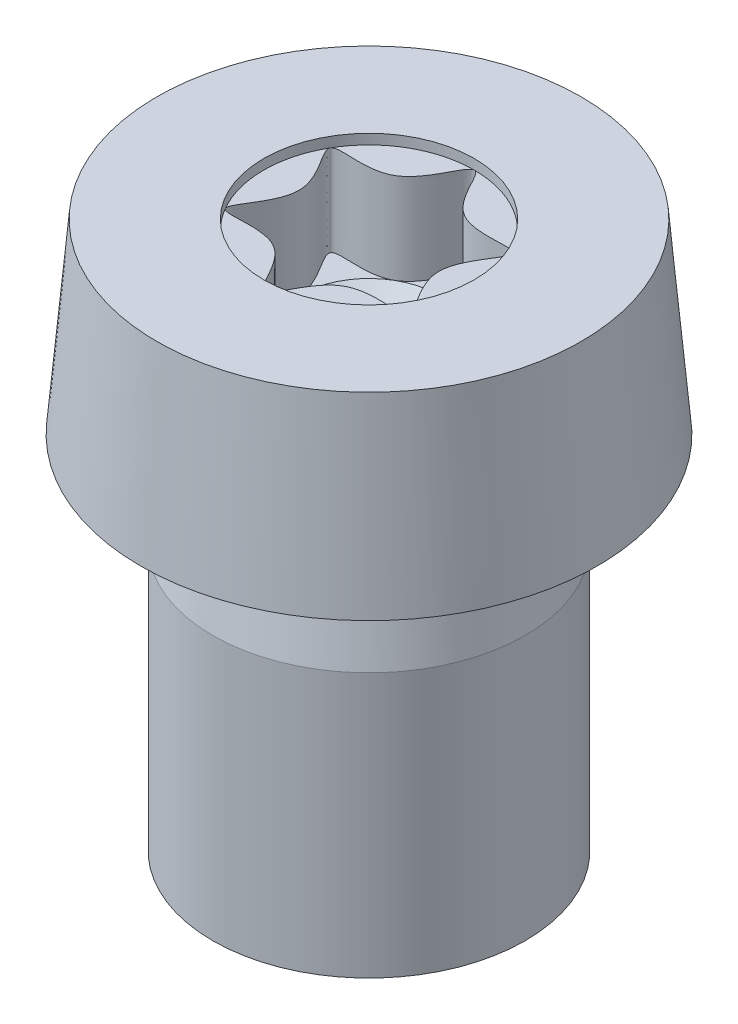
ISO-10303-21;
HEADER;
FILE_DESCRIPTION(('STEP AP214'),'2;1');
FILE_NAME('part.step','',(''),(''),'','','');
FILE_SCHEMA(('AUTOMOTIVE_DESIGN { 1 0 10303 214 1 1 1 1 }'));
ENDSEC;
DATA;
#1=APPLICATION_CONTEXT('core data for automotive mechanical design processes');
#2=APPLICATION_PROTOCOL_DEFINITION('international standard','automotive_design',2000,#1);
#3=PRODUCT_CONTEXT('',#1,'mechanical');
#4=PRODUCT('Part','Part','',(#3));
#5=PRODUCT_RELATED_PRODUCT_CATEGORY('part','',(#4));
#6=PRODUCT_DEFINITION_FORMATION('','',#4);
#7=PRODUCT_DEFINITION_CONTEXT('part definition',#1,'design');
#8=PRODUCT_DEFINITION('design','',#6,#7);
#9=PRODUCT_DEFINITION_SHAPE('','',#8);
#10=(LENGTH_UNIT() NAMED_UNIT(*) SI_UNIT(.MILLI.,.METRE.));
#11=(NAMED_UNIT(*) PLANE_ANGLE_UNIT() SI_UNIT($,.RADIAN.));
#12=(NAMED_UNIT(*) SI_UNIT($,.STERADIAN.) SOLID_ANGLE_UNIT());
#13=UNCERTAINTY_MEASURE_WITH_UNIT(LENGTH_MEASURE(1.E-05),#10,'distance_accuracy_value','');
#14=(GEOMETRIC_REPRESENTATION_CONTEXT(3) GLOBAL_UNCERTAINTY_ASSIGNED_CONTEXT((#13)) GLOBAL_UNIT_ASSIGNED_CONTEXT((#10,
#11,#12)) REPRESENTATION_CONTEXT('',''));
#15=CARTESIAN_POINT('',(0.,0.,0.));
#16=DIRECTION('',(0.,0.,1.));
#17=DIRECTION('',(1.,0.,0.));
#18=AXIS2_PLACEMENT_3D('',#15,#16,#17);
#19=CARTESIAN_POINT('',(0.,3.71,0.875));
#20=DIRECTION('',(0.,1.,0.));
#21=DIRECTION('',(0.,0.,1.));
#22=AXIS2_PLACEMENT_3D('',#19,#20,#21);
#23=PLANE('',#22);
#24=CARTESIAN_POINT('',(0.,3.71,-0.875));
#25=CARTESIAN_POINT('',(0.0629068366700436,3.71,-0.874999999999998));
#26=CARTESIAN_POINT('',(0.188720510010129,3.71,-0.326873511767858));
#27=CARTESIAN_POINT('',(0.995117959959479,3.71,-0.574531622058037));
#28=CARTESIAN_POINT('',(0.377441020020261,3.71,0.));
#29=CARTESIAN_POINT('',(0.995117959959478,3.71,0.574531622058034));
#30=CARTESIAN_POINT('',(0.188720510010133,3.71,0.326873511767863));
#31=CARTESIAN_POINT('',(0.,3.71,1.14906324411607));
#32=CARTESIAN_POINT('',(-0.188720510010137,3.71,0.326873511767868));
#33=CARTESIAN_POINT('',(-0.995117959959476,3.71,0.574531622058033));
#34=CARTESIAN_POINT('',(-0.377441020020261,3.71,0.));
#35=CARTESIAN_POINT('',(-0.995117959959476,3.71,-0.574531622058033));
#36=CARTESIAN_POINT('',(-0.188720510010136,3.71,-0.326873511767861));
#37=CARTESIAN_POINT('',(-0.0629068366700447,3.71,-0.875000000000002));
#38=CARTESIAN_POINT('',(0.,3.71,-0.875));
#39=B_SPLINE_CURVE_WITH_KNOTS('',3,(#24,#25,#26,#27,#28,#29,#30,#31,#32,#33,#34,#35,#36,#37,
#38),.UNSPECIFIED.,.T.,.F.,(4,1,1,1,1,1,1,1,1,1,1,1,4),(0.,0.0833333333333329,0.166666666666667,
0.25,0.333333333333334,0.416666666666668,0.5,0.583333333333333,0.666666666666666,0.75,
0.833333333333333,0.916666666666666,1.),.UNSPECIFIED.);
#40=CARTESIAN_POINT('',(0.291666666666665,3.71,-0.505181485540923));
#41=VERTEX_POINT('',#40);
#42=CARTESIAN_POINT('',(0.583333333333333,3.71,0.));
#43=VERTEX_POINT('',#42);
#44=EDGE_CURVE('E138',#41,#43,#39,.T.);
#45=ORIENTED_EDGE('',*,*,#44,.F.);
#46=CARTESIAN_POINT('',(0.,3.71,0.));
#47=DIRECTION('',(0.,-1.,0.));
#48=DIRECTION('',(0.,0.,-1.));
#49=AXIS2_PLACEMENT_3D('',#46,#47,#48);
#50=CIRCLE('',#49,0.583333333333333);
#51=EDGE_CURVE('E48',#41,#43,#50,.T.);
#52=ORIENTED_EDGE('',*,*,#51,.T.);
#53=EDGE_LOOP('',(#45,#52));
#54=FACE_BOUND('',#53,.T.);
#55=ADVANCED_FACE('F35',(#54),#23,.T.);
#56=CARTESIAN_POINT('',(0.291666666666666,3.71,0.505181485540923));
#57=VERTEX_POINT('',#56);
#58=EDGE_CURVE('E153',#43,#57,#39,.T.);
#59=ORIENTED_EDGE('',*,*,#58,.F.);
#60=EDGE_CURVE('E11',#43,#57,#50,.T.);
#61=ORIENTED_EDGE('',*,*,#60,.T.);
#62=EDGE_LOOP('',(#59,#61));
#63=FACE_BOUND('',#62,.T.);
#64=ADVANCED_FACE('F105',(#63),#23,.T.);
#65=CARTESIAN_POINT('',(-0.291666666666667,3.71,0.505181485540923));
#66=VERTEX_POINT('',#65);
#67=EDGE_CURVE('E146',#57,#66,#39,.T.);
#68=ORIENTED_EDGE('',*,*,#67,.F.);
#69=EDGE_CURVE('E46',#57,#66,#50,.T.);
#70=ORIENTED_EDGE('',*,*,#69,.T.);
#71=EDGE_LOOP('',(#68,#70));
#72=FACE_BOUND('',#71,.T.);
#73=ADVANCED_FACE('F112',(#72),#23,.T.);
#74=CARTESIAN_POINT('',(-0.583333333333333,3.71,0.));
#75=VERTEX_POINT('',#74);
#76=EDGE_CURVE('E144',#66,#75,#39,.T.);
#77=ORIENTED_EDGE('',*,*,#76,.F.);
#78=EDGE_CURVE('E387',#66,#75,#50,.T.);
#79=ORIENTED_EDGE('',*,*,#78,.T.);
#80=EDGE_LOOP('',(#77,#79));
#81=FACE_BOUND('',#80,.T.);
#82=ADVANCED_FACE('F127',(#81),#23,.T.);
#83=CARTESIAN_POINT('',(-0.291666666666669,3.71,-0.505181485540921));
#84=VERTEX_POINT('',#83);
#85=EDGE_CURVE('E135',#75,#84,#39,.T.);
#86=ORIENTED_EDGE('',*,*,#85,.F.);
#87=EDGE_CURVE('E204',#75,#84,#50,.T.);
#88=ORIENTED_EDGE('',*,*,#87,.T.);
#89=EDGE_LOOP('',(#86,#88));
#90=FACE_BOUND('',#89,.T.);
#91=ADVANCED_FACE('F118',(#90),#23,.T.);
#92=EDGE_CURVE('E131',#84,#41,#39,.T.);
#93=ORIENTED_EDGE('',*,*,#92,.F.);
#94=EDGE_CURVE('E133',#84,#41,#50,.T.);
#95=ORIENTED_EDGE('',*,*,#94,.T.);
#96=EDGE_LOOP('',(#93,#95));
#97=FACE_BOUND('',#96,.T.);
#98=ADVANCED_FACE('F108',(#97),#23,.T.);
#99=CARTESIAN_POINT('',(0.,4.55,0.));
#100=DIRECTION('',(0.,1.,0.));
#101=DIRECTION('',(0.,0.,1.));
#102=AXIS2_PLACEMENT_3D('',#99,#100,#101);
#103=PLANE('',#102);
#104=CARTESIAN_POINT('',(0.,4.55,0.));
#105=DIRECTION('',(0.,1.,0.));
#106=DIRECTION('',(0.,0.,1.));
#107=AXIS2_PLACEMENT_3D('',#104,#105,#106);
#108=CIRCLE('',#107,0.875);
#109=CARTESIAN_POINT('',(0.,4.55,0.875));
#110=VERTEX_POINT('',#109);
#111=EDGE_CURVE('E154',#110,#110,#108,.T.);
#112=ORIENTED_EDGE('',*,*,#111,.F.);
#113=EDGE_LOOP('',(#112));
#114=FACE_BOUND('',#113,.T.);
#115=CARTESIAN_POINT('',(0.,4.55,0.));
#116=DIRECTION('',(0.,-1.,0.));
#117=DIRECTION('',(0.,0.,-1.));
#118=AXIS2_PLACEMENT_3D('',#115,#116,#117);
#119=CIRCLE('',#118,1.76439257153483);
#120=CARTESIAN_POINT('',(0.,4.55,-1.76439257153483));
#121=VERTEX_POINT('',#120);
#122=EDGE_CURVE('E152',#121,#121,#119,.T.);
#123=ORIENTED_EDGE('',*,*,#122,.F.);
#124=EDGE_LOOP('',(#123));
#125=FACE_BOUND('',#124,.T.);
#126=ADVANCED_FACE('F117',(#114,#125),#103,.T.);
#127=CARTESIAN_POINT('',(1.3,0.,0.));
#128=DIRECTION('',(0.,-1.,0.));
#129=DIRECTION('',(0.,0.,-1.));
#130=AXIS2_PLACEMENT_3D('',#127,#128,#129);
#131=PLANE('',#130);
#132=CARTESIAN_POINT('',(0.,0.,0.));
#133=DIRECTION('',(0.,-1.,0.));
#134=DIRECTION('',(0.,0.,-1.));
#135=AXIS2_PLACEMENT_3D('',#132,#133,#134);
#136=CIRCLE('',#135,1.3);
#137=CARTESIAN_POINT('',(0.,0.,-1.3));
#138=VERTEX_POINT('',#137);
#139=EDGE_CURVE('E182',#138,#138,#136,.T.);
#140=ORIENTED_EDGE('',*,*,#139,.T.);
#141=EDGE_LOOP('',(#140));
#142=FACE_BOUND('',#141,.T.);
#143=ADVANCED_FACE('F124',(#142),#131,.T.);
#144=CARTESIAN_POINT('',(0.,0.,0.));
#145=DIRECTION('',(0.,-1.,0.));
#146=DIRECTION('',(0.,0.,-1.));
#147=AXIS2_PLACEMENT_3D('',#144,#145,#146);
#148=CYLINDRICAL_SURFACE('',#147,1.3);
#149=CARTESIAN_POINT('',(0.,2.2,0.));
#150=DIRECTION('',(0.,-1.,0.));
#151=DIRECTION('',(0.,0.,-1.));
#152=AXIS2_PLACEMENT_3D('',#149,#150,#151);
#153=CIRCLE('',#152,1.3);
#154=CARTESIAN_POINT('',(0.,2.2,-1.3));
#155=VERTEX_POINT('',#154);
#156=EDGE_CURVE('E185',#155,#155,#153,.T.);
#157=ORIENTED_EDGE('',*,*,#156,.T.);
#158=EDGE_LOOP('',(#157));
#159=FACE_BOUND('',#158,.T.);
#160=ORIENTED_EDGE('',*,*,#139,.F.);
#161=EDGE_LOOP('',(#160));
#162=FACE_BOUND('',#161,.T.);
#163=ADVANCED_FACE('F172',(#159,#162),#148,.T.);
#164=CARTESIAN_POINT('',(0.,2.2,0.));
#165=DIRECTION('',(0.,-1.,0.));
#166=DIRECTION('',(0.,0.,-1.));
#167=AXIS2_PLACEMENT_3D('',#164,#165,#166);
#168=CONICAL_SURFACE('',#167,1.3,0.197395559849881);
#169=CARTESIAN_POINT('',(0.,2.88038838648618,0.));
#170=DIRECTION('',(0.,-1.,0.));
#171=DIRECTION('',(0.,0.,-1.));
#172=AXIS2_PLACEMENT_3D('',#169,#170,#171);
#173=CIRCLE('',#172,1.16392232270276);
#174=CARTESIAN_POINT('',(0.,2.88038838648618,-1.16392232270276));
#175=VERTEX_POINT('',#174);
#176=EDGE_CURVE('E184',#175,#175,#173,.T.);
#177=ORIENTED_EDGE('',*,*,#176,.T.);
#178=EDGE_LOOP('',(#177));
#179=FACE_BOUND('',#178,.T.);
#180=ORIENTED_EDGE('',*,*,#156,.F.);
#181=EDGE_LOOP('',(#180));
#182=FACE_BOUND('',#181,.T.);
#183=ADVANCED_FACE('F168',(#179,#182),#168,.T.);
#184=CARTESIAN_POINT('',(1.9,3.,0.));
#185=DIRECTION('',(0.,-1.,0.));
#186=DIRECTION('',(0.,0.,-1.));
#187=AXIS2_PLACEMENT_3D('',#184,#185,#186);
#188=PLANE('',#187);
#189=CARTESIAN_POINT('',(0.,3.,0.));
#190=DIRECTION('',(0.,-1.,0.));
#191=DIRECTION('',(0.,0.,-1.));
#192=AXIS2_PLACEMENT_3D('',#189,#190,#191);
#193=CIRCLE('',#192,1.26198039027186);
#194=CARTESIAN_POINT('',(0.,3.,-1.26198039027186));
#195=VERTEX_POINT('',#194);
#196=EDGE_CURVE('E188',#195,#195,#193,.F.);
#197=ORIENTED_EDGE('',*,*,#196,.T.);
#198=EDGE_LOOP('',(#197));
#199=FACE_BOUND('',#198,.T.);
#200=CARTESIAN_POINT('',(0.,3.,0.));
#201=DIRECTION('',(0.,-1.,0.));
#202=DIRECTION('',(0.,0.,-1.));
#203=AXIS2_PLACEMENT_3D('',#200,#201,#202);
#204=CIRCLE('',#203,1.9);
#205=CARTESIAN_POINT('',(0.,3.,-1.9));
#206=VERTEX_POINT('',#205);
#207=EDGE_CURVE('E191',#206,#206,#204,.T.);
#208=ORIENTED_EDGE('',*,*,#207,.T.);
#209=EDGE_LOOP('',(#208));
#210=FACE_BOUND('',#209,.T.);
#211=ADVANCED_FACE('F164',(#199,#210),#188,.T.);
#212=CARTESIAN_POINT('',(0.,3.,0.));
#213=DIRECTION('',(0.,-1.,0.));
#214=DIRECTION('',(0.,0.,-1.));
#215=AXIS2_PLACEMENT_3D('',#212,#213,#214);
#216=CONICAL_SURFACE('',#215,1.9,0.08726646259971);
#217=ORIENTED_EDGE('',*,*,#122,.T.);
#218=EDGE_LOOP('',(#217));
#219=FACE_BOUND('',#218,.T.);
#220=ORIENTED_EDGE('',*,*,#207,.F.);
#221=EDGE_LOOP('',(#220));
#222=FACE_BOUND('',#221,.T.);
#223=ADVANCED_FACE('F161',(#219,#222),#216,.T.);
#224=CARTESIAN_POINT('',(0.,2.9,0.));
#225=DIRECTION('',(0.,-1.,0.));
#226=DIRECTION('',(0.,0.,-1.));
#227=AXIS2_PLACEMENT_3D('',#224,#225,#226);
#228=TOROIDAL_SURFACE('',#227,1.26198039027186,0.1);
#229=ORIENTED_EDGE('',*,*,#196,.F.);
#230=EDGE_LOOP('',(#229));
#231=FACE_BOUND('',#230,.T.);
#232=ORIENTED_EDGE('',*,*,#176,.F.);
#233=EDGE_LOOP('',(#232));
#234=FACE_BOUND('',#233,.T.);
#235=ADVANCED_FACE('F37',(#231,#234),#228,.F.);
#236=CARTESIAN_POINT('',(0.,4.466,0.));
#237=DIRECTION('',(0.,1.,0.));
#238=DIRECTION('',(0.,0.,1.));
#239=AXIS2_PLACEMENT_3D('',#236,#237,#238);
#240=CYLINDRICAL_SURFACE('',#239,0.875);
#241=ORIENTED_EDGE('',*,*,#111,.T.);
#242=EDGE_LOOP('',(#241));
#243=FACE_BOUND('',#242,.T.);
#244=CARTESIAN_POINT('',(0.,4.466,0.));
#245=DIRECTION('',(0.,1.,0.));
#246=DIRECTION('',(0.,0.,1.));
#247=AXIS2_PLACEMENT_3D('',#244,#245,#246);
#248=CIRCLE('',#247,0.875);
#249=CARTESIAN_POINT('',(0.757772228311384,4.466,0.4375));
#250=VERTEX_POINT('',#249);
#251=CARTESIAN_POINT('',(0.757772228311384,4.466,-0.4375));
#252=VERTEX_POINT('',#251);
#253=EDGE_CURVE('E224',#250,#252,#248,.T.);
#254=ORIENTED_EDGE('',*,*,#253,.F.);
#255=CARTESIAN_POINT('',(0.,4.466,0.875));
#256=VERTEX_POINT('',#255);
#257=EDGE_CURVE('E136',#256,#250,#248,.T.);
#258=ORIENTED_EDGE('',*,*,#257,.F.);
#259=CARTESIAN_POINT('',(-0.757772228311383,4.466,0.437500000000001));
#260=VERTEX_POINT('',#259);
#261=EDGE_CURVE('E215',#260,#256,#248,.T.);
#262=ORIENTED_EDGE('',*,*,#261,.F.);
#263=CARTESIAN_POINT('',(-0.757772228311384,4.466,-0.4375));
#264=VERTEX_POINT('',#263);
#265=EDGE_CURVE('E220',#264,#260,#248,.T.);
#266=ORIENTED_EDGE('',*,*,#265,.F.);
#267=CARTESIAN_POINT('',(0.,4.466,-0.875));
#268=VERTEX_POINT('',#267);
#269=EDGE_CURVE('E264',#268,#264,#248,.T.);
#270=ORIENTED_EDGE('',*,*,#269,.F.);
#271=EDGE_CURVE('E61',#252,#268,#248,.T.);
#272=ORIENTED_EDGE('',*,*,#271,.F.);
#273=EDGE_LOOP('',(#254,#258,#262,#266,#270,#272));
#274=FACE_BOUND('',#273,.T.);
#275=ADVANCED_FACE('F222',(#243,#274),#240,.F.);
#276=CARTESIAN_POINT('',(0.,4.466,0.));
#277=DIRECTION('',(0.,1.,0.));
#278=DIRECTION('',(0.,0.,1.));
#279=AXIS2_PLACEMENT_3D('',#276,#277,#278);
#280=PLANE('',#279);
#281=ORIENTED_EDGE('',*,*,#269,.T.);
#282=CARTESIAN_POINT('',(0.,4.466,-0.875));
#283=CARTESIAN_POINT('',(0.0629068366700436,4.466,-0.874999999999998));
#284=CARTESIAN_POINT('',(0.188720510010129,4.466,-0.326873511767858));
#285=CARTESIAN_POINT('',(0.995117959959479,4.466,-0.574531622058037));
#286=CARTESIAN_POINT('',(0.377441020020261,4.466,0.));
#287=CARTESIAN_POINT('',(0.995117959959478,4.466,0.574531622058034));
#288=CARTESIAN_POINT('',(0.188720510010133,4.466,0.326873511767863));
#289=CARTESIAN_POINT('',(0.,4.466,1.14906324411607));
#290=CARTESIAN_POINT('',(-0.188720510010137,4.466,0.326873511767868));
#291=CARTESIAN_POINT('',(-0.995117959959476,4.466,0.574531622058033));
#292=CARTESIAN_POINT('',(-0.377441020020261,4.466,0.));
#293=CARTESIAN_POINT('',(-0.995117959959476,4.466,-0.574531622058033));
#294=CARTESIAN_POINT('',(-0.188720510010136,4.466,-0.326873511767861));
#295=CARTESIAN_POINT('',(-0.0629068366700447,4.466,-0.875000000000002));
#296=CARTESIAN_POINT('',(0.,4.466,-0.875));
#297=B_SPLINE_CURVE_WITH_KNOTS('',3,(#282,#283,#284,#285,#286,#287,#288,#289,#290,#291,#292,
#293,#294,#295,#296),.UNSPECIFIED.,.T.,.F.,(4,1,1,1,1,1,1,1,1,1,1,1,4),(0.,0.0833333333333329,
0.166666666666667,0.25,0.333333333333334,0.416666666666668,0.5,0.583333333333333,
0.666666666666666,0.75,0.833333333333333,0.916666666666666,1.),.UNSPECIFIED.);
#298=EDGE_CURVE('E197',#268,#264,#297,.F.);
#299=ORIENTED_EDGE('',*,*,#298,.F.);
#300=EDGE_LOOP('',(#281,#299));
#301=FACE_BOUND('',#300,.T.);
#302=ADVANCED_FACE('F237',(#301),#280,.T.);
#303=ORIENTED_EDGE('',*,*,#265,.T.);
#304=EDGE_CURVE('E201',#264,#260,#297,.F.);
#305=ORIENTED_EDGE('',*,*,#304,.F.);
#306=EDGE_LOOP('',(#303,#305));
#307=FACE_BOUND('',#306,.T.);
#308=ADVANCED_FACE('F242',(#307),#280,.T.);
#309=ORIENTED_EDGE('',*,*,#261,.T.);
#310=EDGE_CURVE('E205',#260,#256,#297,.F.);
#311=ORIENTED_EDGE('',*,*,#310,.F.);
#312=EDGE_LOOP('',(#309,#311));
#313=FACE_BOUND('',#312,.T.);
#314=ADVANCED_FACE('F216',(#313),#280,.T.);
#315=ORIENTED_EDGE('',*,*,#257,.T.);
#316=EDGE_CURVE('E200',#256,#250,#297,.F.);
#317=ORIENTED_EDGE('',*,*,#316,.F.);
#318=EDGE_LOOP('',(#315,#317));
#319=FACE_BOUND('',#318,.T.);
#320=ADVANCED_FACE('F211',(#319),#280,.T.);
#321=ORIENTED_EDGE('',*,*,#253,.T.);
#322=EDGE_CURVE('E196',#250,#252,#297,.F.);
#323=ORIENTED_EDGE('',*,*,#322,.F.);
#324=EDGE_LOOP('',(#321,#323));
#325=FACE_BOUND('',#324,.T.);
#326=ADVANCED_FACE('F246',(#325),#280,.T.);
#327=ORIENTED_EDGE('',*,*,#271,.T.);
#328=EDGE_CURVE('E39',#252,#268,#297,.F.);
#329=ORIENTED_EDGE('',*,*,#328,.F.);
#330=EDGE_LOOP('',(#327,#329));
#331=FACE_BOUND('',#330,.T.);
#332=ADVANCED_FACE('F100',(#331),#280,.T.);
#333=DIRECTION('',(0.,1.,0.));
#334=VECTOR('',#333,1.);
#335=SURFACE_OF_LINEAR_EXTRUSION('',#39,#334);
#336=ORIENTED_EDGE('',*,*,#44,.T.);
#337=ORIENTED_EDGE('',*,*,#58,.T.);
#338=ORIENTED_EDGE('',*,*,#67,.T.);
#339=ORIENTED_EDGE('',*,*,#76,.T.);
#340=ORIENTED_EDGE('',*,*,#85,.T.);
#341=ORIENTED_EDGE('',*,*,#92,.T.);
#342=EDGE_LOOP('',(#336,#337,#338,#339,#340,#341));
#343=FACE_BOUND('',#342,.T.);
#344=ORIENTED_EDGE('',*,*,#328,.T.);
#345=ORIENTED_EDGE('',*,*,#298,.T.);
#346=ORIENTED_EDGE('',*,*,#304,.T.);
#347=ORIENTED_EDGE('',*,*,#310,.T.);
#348=ORIENTED_EDGE('',*,*,#316,.T.);
#349=ORIENTED_EDGE('',*,*,#322,.T.);
#350=EDGE_LOOP('',(#344,#345,#346,#347,#348,#349));
#351=FACE_BOUND('',#350,.T.);
#352=ADVANCED_FACE('F95',(#343,#351),#335,.T.);
#353=CARTESIAN_POINT('',(0.,3.155,0.));
#354=DIRECTION('',(0.,1.,0.));
#355=DIRECTION('',(0.,0.,1.));
#356=AXIS2_PLACEMENT_3D('',#353,#354,#355);
#357=CONICAL_SURFACE('',#356,0.,0.810283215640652);
#358=ORIENTED_EDGE('',*,*,#51,.F.);
#359=ORIENTED_EDGE('',*,*,#94,.F.);
#360=ORIENTED_EDGE('',*,*,#87,.F.);
#361=ORIENTED_EDGE('',*,*,#78,.F.);
#362=ORIENTED_EDGE('',*,*,#69,.F.);
#363=ORIENTED_EDGE('',*,*,#60,.F.);
#364=EDGE_LOOP('',(#358,#359,#360,#361,#362,#363));
#365=FACE_BOUND('',#364,.T.);
#366=CARTESIAN_POINT('',(0.,3.155,0.));
#367=VERTEX_POINT('',#366);
#368=VERTEX_LOOP('',#367);
#369=FACE_BOUND('',#368,.T.);
#370=ADVANCED_FACE('F93',(#365,#369),#357,.F.);
#371=CLOSED_SHELL('',(#55,#64,#73,#82,#91,#98,#126,#143,#163,#183,#211,#223,#235,#275,#302,#308,
#314,#320,#326,#332,#352,#370));
#372=MANIFOLD_SOLID_BREP('B2',#371);
#373=ADVANCED_BREP_SHAPE_REPRESENTATION('',(#18,#372),#14);
#374=SHAPE_DEFINITION_REPRESENTATION(#9,#373);
ENDSEC;
END-ISO-10303-21;
